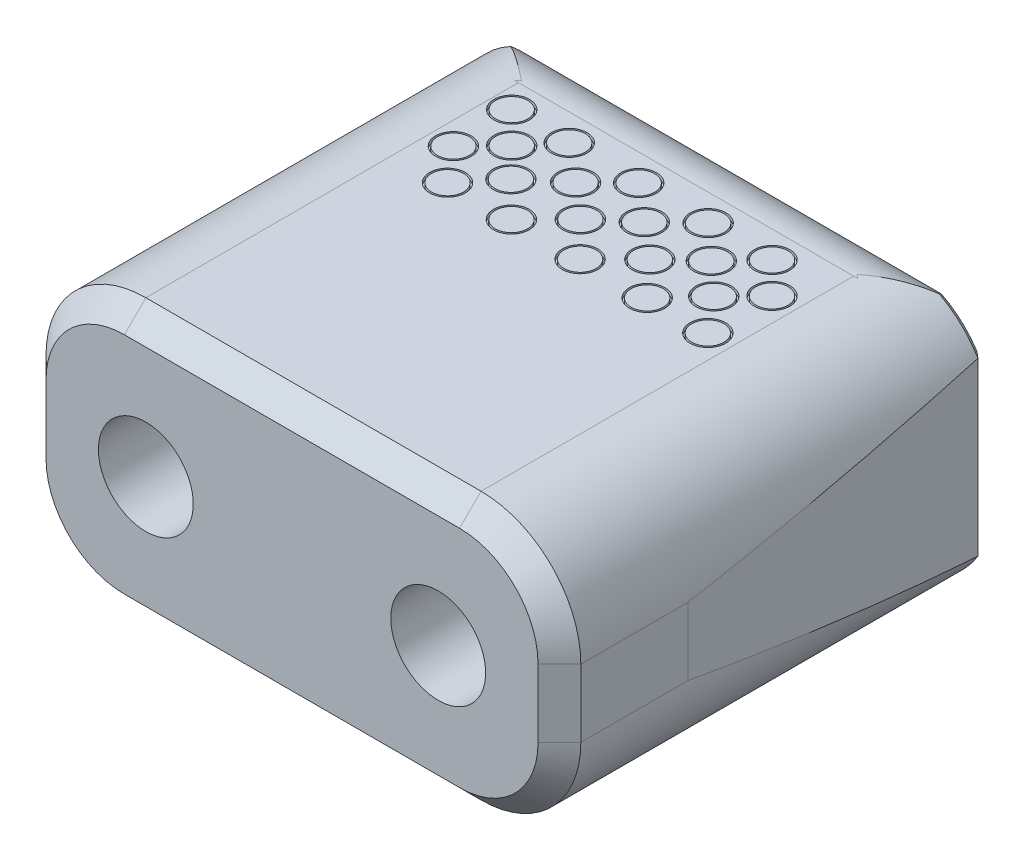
from build123d import *

# Parameters (mm, degrees)
SKETCH3_W                  = 31.242
SKETCH3_H                  = 19.05
EXTRUDE1_DEPTH             = 38.1
F_1_4_20_CBORE_D           = 6.7564
F_1_4_20_CBORE_CBORE_D     = 11.1125
F_1_4_20_CBORE_CBORE_DEPTH = 7.62
FILLET1_R                  = 7.112
CHAMFER1_SIZE              = 0.396875
CHAMFER2_SIZE              = 1.524
CUT_EXTRUDE2_DEPTH         = 51.183644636
CUT_EXTRUDE1_DEPTH         = 12.5
CHAMFER3_SIZE              = 0.396875
CHAMFER3_SIZE2             = 0.441634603
SKETCH9_R                  = 1.27
SKETCH9_R_2                = 1.143
CUT_EXTRUDE3_DEPTH         = 0.254


with BuildPart() as part:
    # Sketch3 → Extrude1 (new body)
    with BuildSketch(Plane(origin=(0, 0, 0), x_dir=(0, 0, -1), z_dir=(1, 0, 0))):
        with Locations((15.621, 0)):
            Rectangle(SKETCH3_W, SKETCH3_H)
    extrude(amount=EXTRUDE1_DEPTH)

    # 1_4_-20 CBORE (through all)
    with Locations(Plane(origin=(0, 0, -31.242), x_dir=(-1, 0, 0), z_dir=(0, 0, -1))):
        with Locations((-8.636, 0), (-29.464, 0)):
            CounterBoreHole(F_1_4_20_CBORE_D / 2, F_1_4_20_CBORE_CBORE_D / 2, F_1_4_20_CBORE_CBORE_DEPTH)

    # Fillet1
    fillet1_edges = [part.edges().sort_by_distance(p)[0] for p in [
        (38.1, 9.525, -15.621),
        (0, 9.525, -15.621),
        (0, -9.525, -15.621),
        (38.1, -9.525, -15.621),
    ]]
    fillet(fillet1_edges, radius=FILLET1_R)

    # Chamfer1
    chamfer1_edges = [part.edges().sort_by_distance(p)[0] for p in [
        (19.05, 9.525, -31.242),
        (0, 0, -31.242),
        (38.1, 0, -31.242),
        (19.05, -9.525, -31.242),
        (36.016943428, 7.441943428, -31.242),
        (36.016943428, -7.441943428, -31.242),
        (2.083056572, -7.441943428, -31.242),
        (2.083056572, 7.441943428, -31.242),
    ]]
    chamfer(chamfer1_edges, length=CHAMFER1_SIZE)

    # Chamfer2
    chamfer2_edges = [part.edges().sort_by_distance(p)[0] for p in [
        (19.05, 9.525, 0),
        (0, 0, 0),
        (19.05, -9.525, 0),
        (38.1, 0, 0),
        (36.016943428, 7.441943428, 0),
        (36.016943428, -7.441943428, 0),
        (2.083056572, -7.441943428, 0),
        (2.083056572, 7.441943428, 0),
    ]]
    chamfer(chamfer2_edges, length=CHAMFER2_SIZE)

    # Sketch8 → Cut-Extrude2 (cut, through all)
    with BuildSketch(Plane.ZY):
        with BuildLine():
            Line((-31.242, -8.376335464), (-40.767, -8.376335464))
            Line((-40.767, -8.376335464), (-40.767, -22.219335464))
            Line((-40.767, -22.219335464), (-28.067, -22.219335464))
            Line((-28.067, -22.219335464), (-28.067, -9.519335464))
            ThreePointArc((-28.067, -9.519335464), (-29.769302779, -9.266732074), (-31.242, -8.376335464))
        make_face()
        with BuildLine():
            Line((-40.767, 22.219335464), (-40.767, 8.376335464))
            Line((-40.767, 8.376335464), (-31.242, 8.376335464))
            ThreePointArc((-31.242, 8.376335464), (-29.769302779, 9.266732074), (-28.067, 9.519335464))
            Line((-28.067, 9.519335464), (-28.067, 22.219335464))
            Line((-28.067, 22.219335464), (-40.767, 22.219335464))
        make_face()
    extrude(amount=-CUT_EXTRUDE2_DEPTH, mode=Mode.SUBTRACT)

    # Sketch5 → Cut-Extrude1 (cut, symmetric)
    with BuildSketch(Plane(origin=(0, 0, 0), x_dir=(1, 0, 0), z_dir=(0, 1, 0))):
        with BuildLine():
            Line((38.1, 9.144), (50.8, 9.144))
            Line((50.8, 9.144), (50.8, 34.544))
            Line((50.8, 34.544), (36.684506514, 34.544))
            ThreePointArc((36.684506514, 34.544), (37.745852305, 21.8637054), (38.1, 9.144))
        make_face()
    cut_extrude1 = extrude(amount=CUT_EXTRUDE1_DEPTH, both=True, mode=Mode.SUBTRACT)

    # Mirror4: Cut-Extrude1 across plane
    add(cut_extrude1.mirror(Plane(origin=(19.05, 0, 0), x_dir=(0, 0, 1), z_dir=(1, 0, 0))), mode=Mode.SUBTRACT)

    # Chamfer3
    chamfer3_edges = [part.edges().sort_by_distance(p)[0] for p in [
        (37.029423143, 0, -31.242),
    ]]
    chamfer3_side = [part.faces().sort_by_distance(p)[0] for p in [
        (37.832198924, 0, -20.2059589),
    ]]
    chamfer(chamfer3_edges, length=CHAMFER3_SIZE, length2=CHAMFER3_SIZE2, reference=chamfer3_side[0])

    # Sketch9 → Cut-Extrude3 (cut)
    # profile 1 of 20: a face of its own
    with BuildSketch(Plane(origin=(0, 9.525, 0), x_dir=(1, 0, 0), z_dir=(0, 1, 0))):
        with Locations(Location((12.638524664, 26.155996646, 0), (0, 0, 270))):
            Circle(SKETCH9_R)
        with Locations(Location((12.638524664, 26.155996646, 0), (0, 0, 270))):
            Circle(SKETCH9_R_2, mode=Mode.SUBTRACT)
    # profile 2 of 20: a face of its own
    with BuildSketch(Plane(origin=(0, 9.525, 0), x_dir=(1, 0, 0), z_dir=(0, 1, 0))):
        with Locations(Location((17.587514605, 26.155996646, 0), (0, 0, 270))):
            Circle(SKETCH9_R)
        with Locations(Location((17.587514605, 26.155996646, 0), (0, 0, 270))):
            Circle(SKETCH9_R_2, mode=Mode.SUBTRACT)
    # profile 3 of 20: a face of its own
    with BuildSketch(Plane(origin=(0, 9.525, 0), x_dir=(1, 0, 0), z_dir=(0, 1, 0))):
        with Locations(Location((22.536504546, 26.155996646, 0), (0, 0, 270))):
            Circle(SKETCH9_R)
        with Locations(Location((22.536504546, 26.155996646, 0), (0, 0, 270))):
            Circle(SKETCH9_R_2, mode=Mode.SUBTRACT)
    # profile 4 of 20: a face of its own
    with BuildSketch(Plane(origin=(0, 9.525, 0), x_dir=(1, 0, 0), z_dir=(0, 1, 0))):
        with Locations(Location((27.087299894, 26.155996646, 0), (0, 0, 270))):
            Circle(SKETCH9_R)
        with Locations(Location((27.087299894, 26.155996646, 0), (0, 0, 270))):
            Circle(SKETCH9_R_2, mode=Mode.SUBTRACT)
    # profile 5 of 20: a face of its own
    with BuildSketch(Plane(origin=(0, 9.525, 0), x_dir=(1, 0, 0), z_dir=(0, 1, 0))):
        with Locations(Location((15.312116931, 23.937483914, 0), (0, 0, 270))):
            Circle(SKETCH9_R)
        with Locations(Location((15.312116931, 23.937483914, 0), (0, 0, 270))):
            Circle(SKETCH9_R_2, mode=Mode.SUBTRACT)
    # profile 6 of 20: a face of its own
    with BuildSketch(Plane(origin=(0, 9.525, 0), x_dir=(1, 0, 0), z_dir=(0, 1, 0))):
        with Locations(Location((20.20422193, 23.937483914, 0), (0, 0, 270))):
            Circle(SKETCH9_R)
        with Locations(Location((20.20422193, 23.937483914, 0), (0, 0, 270))):
            Circle(SKETCH9_R_2, mode=Mode.SUBTRACT)
    # profile 7 of 20: a face of its own
    with BuildSketch(Plane(origin=(0, 9.525, 0), x_dir=(1, 0, 0), z_dir=(0, 1, 0))):
        with Locations(Location((24.982557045, 23.937483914, 0), (0, 0, 270))):
            Circle(SKETCH9_R)
        with Locations(Location((24.982557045, 23.937483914, 0), (0, 0, 270))):
            Circle(SKETCH9_R_2, mode=Mode.SUBTRACT)
    # profile 8 of 20: a face of its own
    with BuildSketch(Plane(origin=(0, 9.525, 0), x_dir=(1, 0, 0), z_dir=(0, 1, 0))):
        with Locations(Location((29.305812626, 23.937483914, 0), (0, 0, 270))):
            Circle(SKETCH9_R)
        with Locations(Location((29.305812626, 23.937483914, 0), (0, 0, 270))):
            Circle(SKETCH9_R_2, mode=Mode.SUBTRACT)
    # profile 9 of 20: a face of its own
    with BuildSketch(Plane(origin=(0, 9.525, 0), x_dir=(1, 0, 0), z_dir=(0, 1, 0))):
        with Locations(Location((12.809179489, 21.832741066, 0), (0, 0, 270))):
            Circle(SKETCH9_R)
        with Locations(Location((12.809179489, 21.832741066, 0), (0, 0, 270))):
            Circle(SKETCH9_R_2, mode=Mode.SUBTRACT)
    # profile 10 of 20: a face of its own
    with BuildSketch(Plane(origin=(0, 9.525, 0), x_dir=(1, 0, 0), z_dir=(0, 1, 0))):
        with Locations(Location((10.761321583, 23.937483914, 0), (0, 0, 270))):
            Circle(SKETCH9_R)
        with Locations(Location((10.761321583, 23.937483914, 0), (0, 0, 270))):
            Circle(SKETCH9_R_2, mode=Mode.SUBTRACT)
    # profile 11 of 20: a face of its own
    with BuildSketch(Plane(origin=(0, 9.525, 0), x_dir=(1, 0, 0), z_dir=(0, 1, 0))):
        with Locations(Location((17.75816943, 21.832741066, 0), (0, 0, 270))):
            Circle(SKETCH9_R)
        with Locations(Location((17.75816943, 21.832741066, 0), (0, 0, 270))):
            Circle(SKETCH9_R_2, mode=Mode.SUBTRACT)
    # profile 12 of 20: a face of its own
    with BuildSketch(Plane(origin=(0, 9.525, 0), x_dir=(1, 0, 0), z_dir=(0, 1, 0))):
        with Locations(Location((22.707159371, 21.832741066, 0), (0, 0, 270))):
            Circle(SKETCH9_R)
        with Locations(Location((22.707159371, 21.832741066, 0), (0, 0, 270))):
            Circle(SKETCH9_R_2, mode=Mode.SUBTRACT)
    # profile 13 of 20: a face of its own
    with BuildSketch(Plane(origin=(0, 9.525, 0), x_dir=(1, 0, 0), z_dir=(0, 1, 0))):
        with Locations(Location((8.542808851, 26.155996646, 0), (0, 0, 270))):
            Circle(SKETCH9_R)
        with Locations(Location((8.542808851, 26.155996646, 0), (0, 0, 270))):
            Circle(SKETCH9_R_2, mode=Mode.SUBTRACT)
    # profile 14 of 20: a face of its own
    with BuildSketch(Plane(origin=(0, 9.525, 0), x_dir=(1, 0, 0), z_dir=(0, 1, 0))):
        with Locations(Location((27.257954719, 21.832741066, 0), (0, 0, 270))):
            Circle(SKETCH9_R)
        with Locations(Location((27.257954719, 21.832741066, 0), (0, 0, 270))):
            Circle(SKETCH9_R_2, mode=Mode.SUBTRACT)
    # profile 15 of 20: a face of its own
    with BuildSketch(Plane(origin=(0, 9.525, 0), x_dir=(1, 0, 0), z_dir=(0, 1, 0))):
        with Locations(Location((8.713463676, 21.832741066, 0), (0, 0, 270))):
            Circle(SKETCH9_R)
        with Locations(Location((8.713463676, 21.832741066, 0), (0, 0, 270))):
            Circle(SKETCH9_R_2, mode=Mode.SUBTRACT)
    # profile 16 of 20: a face of its own
    with BuildSketch(Plane(origin=(0, 9.525, 0), x_dir=(1, 0, 0), z_dir=(0, 1, 0))):
        with Locations(Location((15.312116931, 19.365483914, 0), (0, 0, 270))):
            Circle(SKETCH9_R)
        with Locations(Location((15.312116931, 19.365483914, 0), (0, 0, 270))):
            Circle(SKETCH9_R_2, mode=Mode.SUBTRACT)
    # profile 17 of 20: a face of its own
    with BuildSketch(Plane(origin=(0, 9.525, 0), x_dir=(1, 0, 0), z_dir=(0, 1, 0))):
        with Locations(Location((20.20422193, 19.365483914, 0), (0, 0, 270))):
            Circle(SKETCH9_R)
        with Locations(Location((20.20422193, 19.365483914, 0), (0, 0, 270))):
            Circle(SKETCH9_R_2, mode=Mode.SUBTRACT)
    # profile 18 of 20: a face of its own
    with BuildSketch(Plane(origin=(0, 9.525, 0), x_dir=(1, 0, 0), z_dir=(0, 1, 0))):
        with Locations(Location((24.982557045, 19.365483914, 0), (0, 0, 270))):
            Circle(SKETCH9_R)
        with Locations(Location((24.982557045, 19.365483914, 0), (0, 0, 270))):
            Circle(SKETCH9_R_2, mode=Mode.SUBTRACT)
    # profile 19 of 20: a face of its own
    with BuildSketch(Plane(origin=(0, 9.525, 0), x_dir=(1, 0, 0), z_dir=(0, 1, 0))):
        with Locations(Location((29.305812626, 19.365483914, 0), (0, 0, 270))):
            Circle(SKETCH9_R)
        with Locations(Location((29.305812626, 19.365483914, 0), (0, 0, 270))):
            Circle(SKETCH9_R_2, mode=Mode.SUBTRACT)
    # profile 20 of 20: a face of its own
    with BuildSketch(Plane(origin=(0, 9.525, 0), x_dir=(1, 0, 0), z_dir=(0, 1, 0))):
        with Locations(Location((10.761321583, 19.365483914, 0), (0, 0, 270))):
            Circle(SKETCH9_R)
        with Locations(Location((10.761321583, 19.365483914, 0), (0, 0, 270))):
            Circle(SKETCH9_R_2, mode=Mode.SUBTRACT)
    cut_extrude3 = extrude(amount=-CUT_EXTRUDE3_DEPTH, mode=Mode.SUBTRACT)

    # Mirror3: Cut-Extrude3 across plane
    add(cut_extrude3.mirror(Plane.ZX), mode=Mode.SUBTRACT)


solid = part.part
